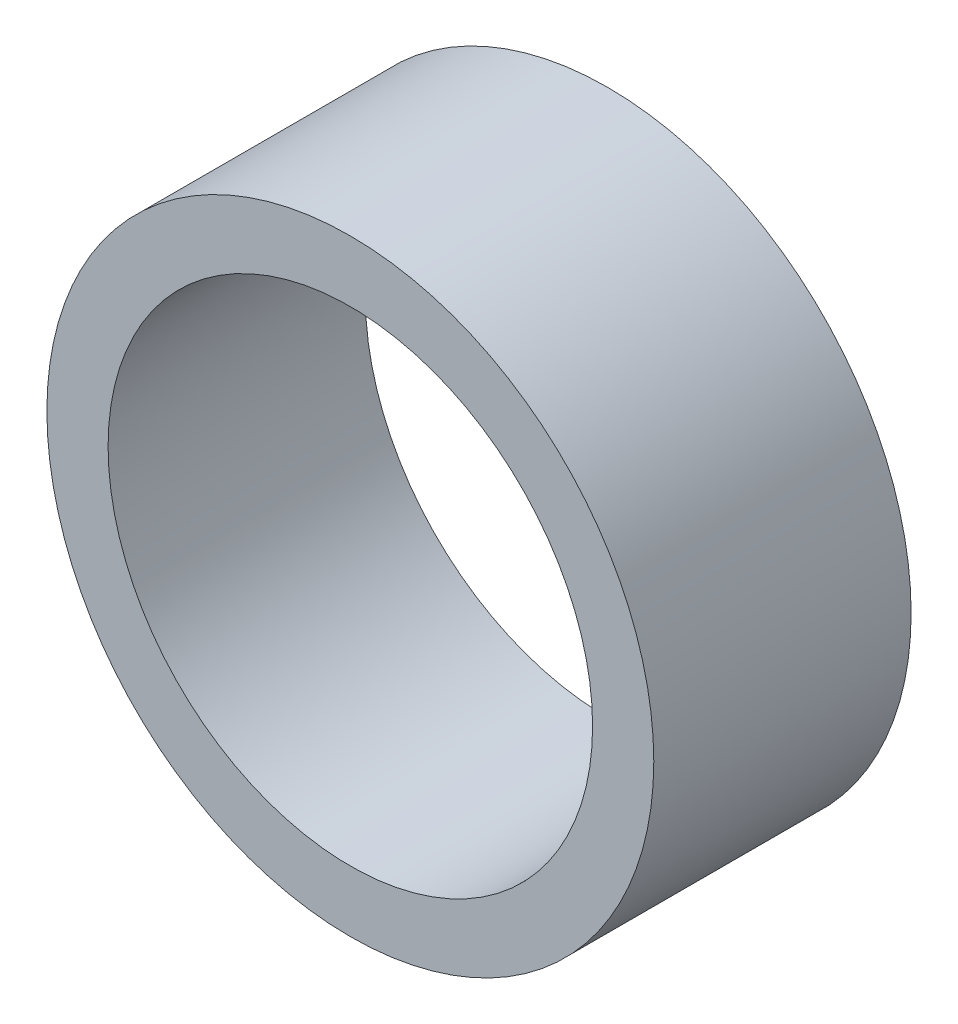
from build123d import *

# Parameters (mm, degrees)
SKETCH1_R          = 6.14045
EXTRUDE1_DEPTH     = 5.207
SKETCH5_R          = 4.9022
CUT_EXTRUDE3_DEPTH = 11.873695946


with BuildPart() as part:
    # Sketch1 → Extrude1 (new body)
    with BuildSketch(Plane.XY):
        with Locations((1.1684, 0)):
            Circle(SKETCH1_R)
    extrude(amount=EXTRUDE1_DEPTH)

    # Sketch5 → Cut-Extrude3 (cut, through all)
    with BuildSketch(Plane(origin=(0, 0, 0), x_dir=(-1, 0, 0), z_dir=(0, 0, -1))):
        with Locations((-1.1684, 0)):
            Circle(SKETCH5_R)
    extrude(amount=-CUT_EXTRUDE3_DEPTH, mode=Mode.SUBTRACT)


solid = part.part
